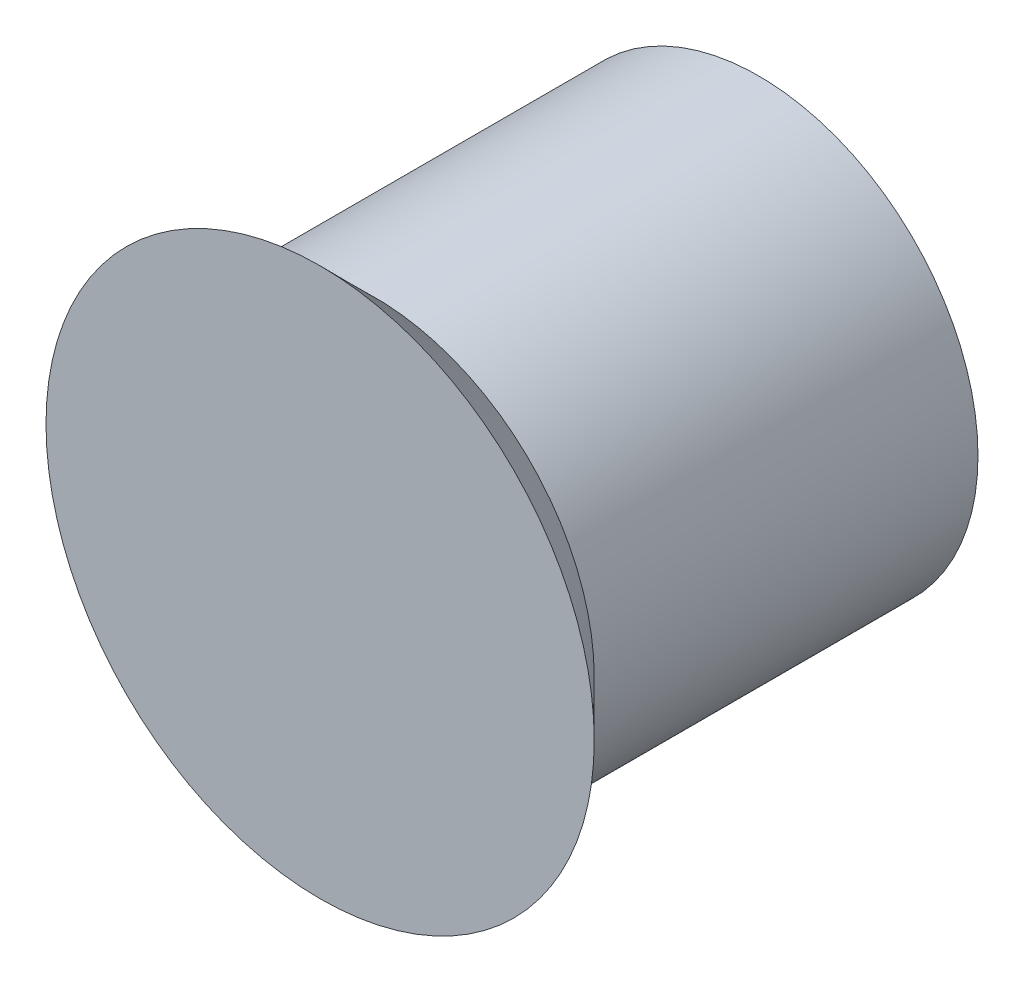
from build123d import *

# Parameters (mm, degrees)
IZIM1_R                     = 4
Y_KSEKLIK_EKSTR_ZYON1_DEPTH = 7
IZIM2_R                     = 4
Y_KSEKLIK_EKSTR_ZYON2_DEPTH = 1
Y_KSEKLIK_EKSTR_ZYON2_DRAFT = -45


with BuildPart() as part:
    # izim1 → Y_kseklik-Ekstr_zyon1 (new body)
    with BuildSketch(Plane.XY):
        Circle(IZIM1_R)
    extrude(amount=Y_KSEKLIK_EKSTR_ZYON1_DEPTH)


with BuildPart() as y_kseklik_ekstr_zyon2_tool:
    # izim2 → Y_kseklik-Ekstr_zyon2 (with draft: the straight prism first)
    with BuildSketch(Plane.XY.offset(7)):
        Circle(IZIM2_R)
    extrude(amount=Y_KSEKLIK_EKSTR_ZYON2_DEPTH)
    # Y_kseklik-Ekstr_zyon2: the draft: its side faces are tilted about the plane it starts from
    y_kseklik_ekstr_zyon2_sides = [y_kseklik_ekstr_zyon2_tool.faces().sort_by_distance(p)[0] for p in [
        (-4, 0, 7.5),
    ]]
    draft(y_kseklik_ekstr_zyon2_sides, Plane.XY.offset(7), Y_KSEKLIK_EKSTR_ZYON2_DRAFT)


with BuildPart() as part_1:
    add(part.part)

    # Y_kseklik-Ekstr_zyon2: add y_kseklik_ekstr_zyon2_tool
    add(y_kseklik_ekstr_zyon2_tool.part)


solid = part_1.part
